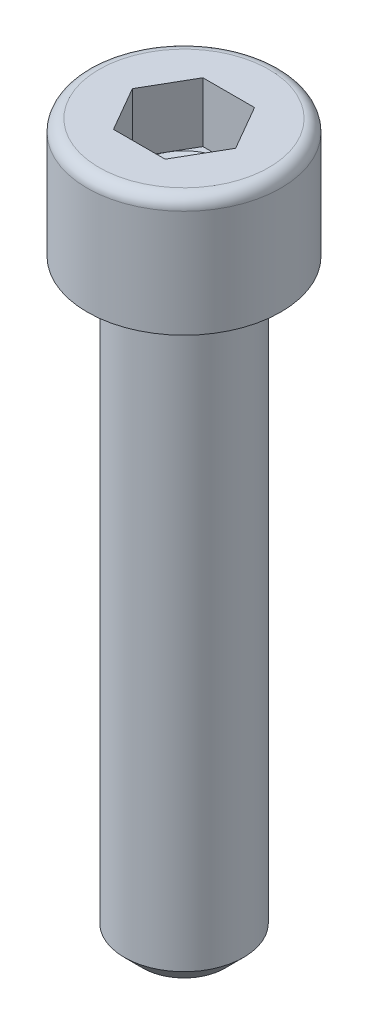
from build123d import *

# Parameters (mm, degrees)
TIGE_START              = -40
ESQUISSE1_R             = 4
TIGE_DEPTH              = 40
CHANFREIN_D_ENTR_E_SIZE = 1.25
HEXAGONE_DEPTH          = 4


with BuildPart() as part:
    # Esquisse1 → Tige (new body)
    with BuildSketch(Plane(origin=(0, 0, 0), x_dir=(1, 0, 0), z_dir=(0, 1, 0)).offset(TIGE_START)):
        with Locations(Location((0, 0, 0), (0, 0, 270))):
            Circle(ESQUISSE1_R)
    extrude(amount=TIGE_DEPTH)

    # Chanfrein d_entr_e
    chanfrein_d_entr_e_edges = [part.edges().sort_by_distance(p)[0] for p in [
        (0, -40, -4),
    ]]
    chamfer(chanfrein_d_entr_e_edges, length=CHANFREIN_D_ENTR_E_SIZE)

    # Esquisse2 → T_te (revolve)
    with BuildSketch(Plane.XY, mode=Mode.PRIVATE) as t_te_sk:
        with BuildLine():
            Line((3, 8), (3, 4))
            Line((3, 4), (0, 2.267949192))
            Line((0, 2.267949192), (0, 0))
            Line((0, 0), (6.5, 0))
            Line((6.5, 0), (6.5, 7.2))
            ThreePointArc((6.5, 7.2), (6.265685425, 7.765685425), (5.7, 8))
            Line((5.7, 8), (3, 8))
        make_face()
    revolve(t_te_sk.sketch.rotate(Axis((0, 8, 0), (0, -1, 0)), 180), axis=Axis((0, 8, 0), (0, -1, 0)))

    # Esquisse3 → Hexagone (cut)
    with BuildSketch(Plane(origin=(0, 8, -3), x_dir=(1, 0, 0), z_dir=(0, -1, 0))):
        Polygon((1.732050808, 6), (-1.732050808, 6), (-3.464101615, 3), (-1.732050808, 0), (1.732050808, 0), (3.464101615, 3), align=None)
    extrude(amount=HEXAGONE_DEPTH, mode=Mode.SUBTRACT)


solid = part.part
